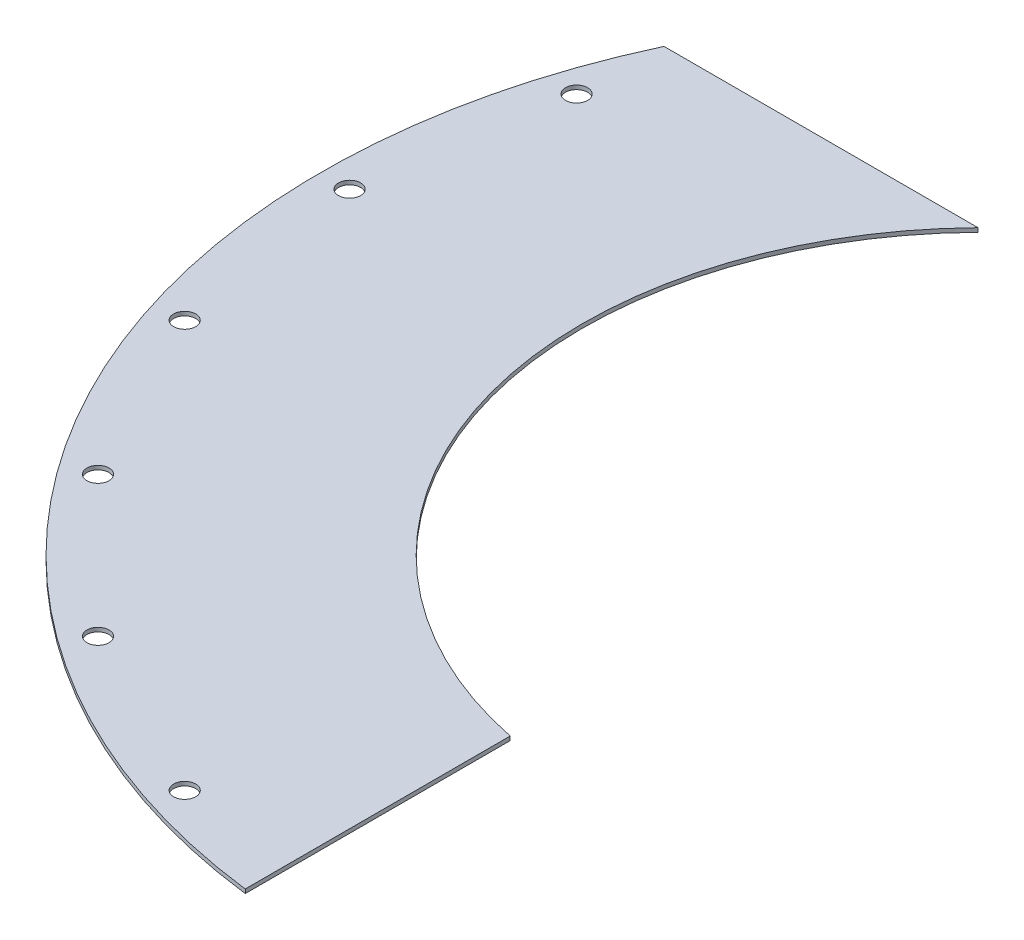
ISO-10303-21;
HEADER;
FILE_DESCRIPTION(('STEP AP214'),'2;1');
FILE_NAME('part.step','',(''),(''),'','','');
FILE_SCHEMA(('AUTOMOTIVE_DESIGN { 1 0 10303 214 1 1 1 1 }'));
ENDSEC;
DATA;
#1=APPLICATION_CONTEXT('core data for automotive mechanical design processes');
#2=APPLICATION_PROTOCOL_DEFINITION('international standard','automotive_design',2000,#1);
#3=PRODUCT_CONTEXT('',#1,'mechanical');
#4=PRODUCT('Part','Part','',(#3));
#5=PRODUCT_RELATED_PRODUCT_CATEGORY('part','',(#4));
#6=PRODUCT_DEFINITION_FORMATION('','',#4);
#7=PRODUCT_DEFINITION_CONTEXT('part definition',#1,'design');
#8=PRODUCT_DEFINITION('design','',#6,#7);
#9=PRODUCT_DEFINITION_SHAPE('','',#8);
#10=(LENGTH_UNIT() NAMED_UNIT(*) SI_UNIT(.MILLI.,.METRE.));
#11=(NAMED_UNIT(*) PLANE_ANGLE_UNIT() SI_UNIT($,.RADIAN.));
#12=(NAMED_UNIT(*) SI_UNIT($,.STERADIAN.) SOLID_ANGLE_UNIT());
#13=UNCERTAINTY_MEASURE_WITH_UNIT(LENGTH_MEASURE(1.E-05),#10,'distance_accuracy_value','');
#14=(GEOMETRIC_REPRESENTATION_CONTEXT(3) GLOBAL_UNCERTAINTY_ASSIGNED_CONTEXT((#13)) GLOBAL_UNIT_ASSIGNED_CONTEXT((#10,
#11,#12)) REPRESENTATION_CONTEXT('',''));
#15=CARTESIAN_POINT('',(0.,0.,0.));
#16=DIRECTION('',(0.,0.,1.));
#17=DIRECTION('',(1.,0.,0.));
#18=AXIS2_PLACEMENT_3D('',#15,#16,#17);
#19=CARTESIAN_POINT('',(0.,0.,0.));
#20=DIRECTION('',(0.,1.,0.));
#21=DIRECTION('',(0.,0.,1.));
#22=AXIS2_PLACEMENT_3D('',#19,#20,#21);
#23=PLANE('',#22);
#24=CARTESIAN_POINT('',(90.,0.,86.));
#25=DIRECTION('',(0.,1.,0.));
#26=DIRECTION('',(0.,0.,1.));
#27=AXIS2_PLACEMENT_3D('',#24,#25,#26);
#28=CIRCLE('',#27,165.215011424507);
#29=CARTESIAN_POINT('',(-59.6529318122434,0.,16.0000000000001));
#30=VERTEX_POINT('',#29);
#31=CARTESIAN_POINT('',(70.,0.,250.));
#32=VERTEX_POINT('',#31);
#33=EDGE_CURVE('E56',#30,#32,#28,.T.);
#34=ORIENTED_EDGE('',*,*,#33,.F.);
#35=DIRECTION('',(1.,0.,0.));
#36=VECTOR('',#35,1.);
#37=CARTESIAN_POINT('',(-59.6529318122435,0.,16.0000000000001));
#38=LINE('',#37,#36);
#39=CARTESIAN_POINT('',(18.5857157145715,0.,16.0000000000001));
#40=VERTEX_POINT('',#39);
#41=EDGE_CURVE('E61',#30,#40,#38,.T.);
#42=ORIENTED_EDGE('',*,*,#41,.T.);
#43=CARTESIAN_POINT('',(90.,0.,86.));
#44=DIRECTION('',(0.,1.,0.));
#45=DIRECTION('',(0.,0.,1.));
#46=AXIS2_PLACEMENT_3D('',#43,#44,#45);
#47=CIRCLE('',#46,100.);
#48=CARTESIAN_POINT('',(70.,0.,183.979589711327));
#49=VERTEX_POINT('',#48);
#50=EDGE_CURVE('E103',#40,#49,#47,.T.);
#51=ORIENTED_EDGE('',*,*,#50,.T.);
#52=DIRECTION('',(0.,0.,1.));
#53=VECTOR('',#52,1.);
#54=CARTESIAN_POINT('',(70.,0.,250.));
#55=LINE('',#54,#53);
#56=EDGE_CURVE('E62',#49,#32,#55,.T.);
#57=ORIENTED_EDGE('',*,*,#56,.T.);
#58=EDGE_LOOP('',(#34,#42,#51,#57));
#59=FACE_BOUND('',#58,.T.);
#60=CARTESIAN_POINT('',(-68.,0.,86.0000000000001));
#61=DIRECTION('',(0.,1.,0.));
#62=DIRECTION('',(0.,0.,1.));
#63=AXIS2_PLACEMENT_3D('',#60,#61,#62);
#64=CIRCLE('',#63,2.75);
#65=CARTESIAN_POINT('',(-68.,0.,88.7500000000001));
#66=VERTEX_POINT('',#65);
#67=EDGE_CURVE('E65',#66,#66,#64,.T.);
#68=ORIENTED_EDGE('',*,*,#67,.T.);
#69=EDGE_LOOP('',(#68));
#70=FACE_BOUND('',#69,.T.);
#71=CARTESIAN_POINT('',(-60.2669295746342,0.,134.824685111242));
#72=DIRECTION('',(0.,1.,0.));
#73=DIRECTION('',(0.,0.,1.));
#74=AXIS2_PLACEMENT_3D('',#71,#72,#73);
#75=CIRCLE('',#74,2.75);
#76=CARTESIAN_POINT('',(-60.2669295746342,0.,137.574685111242));
#77=VERTEX_POINT('',#76);
#78=EDGE_CURVE('E108',#77,#77,#75,.T.);
#79=ORIENTED_EDGE('',*,*,#78,.T.);
#80=EDGE_LOOP('',(#79));
#81=FACE_BOUND('',#80,.T.);
#82=CARTESIAN_POINT('',(-37.8246851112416,0.,178.870069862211));
#83=DIRECTION('',(0.,1.,0.));
#84=DIRECTION('',(0.,0.,1.));
#85=AXIS2_PLACEMENT_3D('',#82,#83,#84);
#86=CIRCLE('',#85,2.75);
#87=CARTESIAN_POINT('',(-37.8246851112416,0.,181.620069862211));
#88=VERTEX_POINT('',#87);
#89=EDGE_CURVE('E111',#88,#88,#86,.T.);
#90=ORIENTED_EDGE('',*,*,#89,.T.);
#91=EDGE_LOOP('',(#90));
#92=FACE_BOUND('',#91,.T.);
#93=CARTESIAN_POINT('',(-2.87006986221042,0.,213.824685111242));
#94=DIRECTION('',(0.,1.,0.));
#95=DIRECTION('',(0.,0.,1.));
#96=AXIS2_PLACEMENT_3D('',#93,#94,#95);
#97=CIRCLE('',#96,2.75);
#98=CARTESIAN_POINT('',(-2.87006986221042,0.,216.574685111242));
#99=VERTEX_POINT('',#98);
#100=EDGE_CURVE('E114',#99,#99,#97,.T.);
#101=ORIENTED_EDGE('',*,*,#100,.T.);
#102=EDGE_LOOP('',(#101));
#103=FACE_BOUND('',#102,.T.);
#104=CARTESIAN_POINT('',(41.1753148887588,0.,236.266929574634));
#105=DIRECTION('',(0.,1.,0.));
#106=DIRECTION('',(0.,0.,1.));
#107=AXIS2_PLACEMENT_3D('',#104,#105,#106);
#108=CIRCLE('',#107,2.75);
#109=CARTESIAN_POINT('',(41.1753148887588,0.,239.016929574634));
#110=VERTEX_POINT('',#109);
#111=EDGE_CURVE('E116',#110,#110,#108,.T.);
#112=ORIENTED_EDGE('',*,*,#111,.T.);
#113=EDGE_LOOP('',(#112));
#114=FACE_BOUND('',#113,.T.);
#115=CARTESIAN_POINT('',(-60.2669295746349,0.,37.1753148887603));
#116=DIRECTION('',(0.,1.,0.));
#117=DIRECTION('',(0.,0.,1.));
#118=AXIS2_PLACEMENT_3D('',#115,#116,#117);
#119=CIRCLE('',#118,2.75000000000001);
#120=CARTESIAN_POINT('',(-60.2669295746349,0.,39.9253148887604));
#121=VERTEX_POINT('',#120);
#122=EDGE_CURVE('E20',#121,#121,#119,.T.);
#123=ORIENTED_EDGE('',*,*,#122,.T.);
#124=EDGE_LOOP('',(#123));
#125=FACE_BOUND('',#124,.T.);
#126=ADVANCED_FACE('F17',(#59,#70,#81,#92,#103,#114,#125),#23,.F.);
#127=CARTESIAN_POINT('',(-60.2669295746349,0.,37.1753148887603));
#128=DIRECTION('',(0.,1.,0.));
#129=DIRECTION('',(0.,0.,1.));
#130=AXIS2_PLACEMENT_3D('',#127,#128,#129);
#131=CYLINDRICAL_SURFACE('',#130,2.75000000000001);
#132=CARTESIAN_POINT('',(-60.2669295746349,1.,37.1753148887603));
#133=DIRECTION('',(0.,1.,0.));
#134=DIRECTION('',(0.,0.,1.));
#135=AXIS2_PLACEMENT_3D('',#132,#133,#134);
#136=CIRCLE('',#135,2.75000000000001);
#137=CARTESIAN_POINT('',(-60.2669295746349,1.,39.9253148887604));
#138=VERTEX_POINT('',#137);
#139=EDGE_CURVE('E75',#138,#138,#136,.F.);
#140=ORIENTED_EDGE('',*,*,#139,.F.);
#141=EDGE_LOOP('',(#140));
#142=FACE_BOUND('',#141,.T.);
#143=ORIENTED_EDGE('',*,*,#122,.F.);
#144=EDGE_LOOP('',(#143));
#145=FACE_BOUND('',#144,.T.);
#146=ADVANCED_FACE('F124',(#142,#145),#131,.F.);
#147=CARTESIAN_POINT('',(41.1753148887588,0.,236.266929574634));
#148=DIRECTION('',(0.,1.,0.));
#149=DIRECTION('',(0.,0.,1.));
#150=AXIS2_PLACEMENT_3D('',#147,#148,#149);
#151=CYLINDRICAL_SURFACE('',#150,2.75);
#152=CARTESIAN_POINT('',(41.1753148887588,1.,236.266929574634));
#153=DIRECTION('',(0.,1.,0.));
#154=DIRECTION('',(0.,0.,1.));
#155=AXIS2_PLACEMENT_3D('',#152,#153,#154);
#156=CIRCLE('',#155,2.75);
#157=CARTESIAN_POINT('',(41.1753148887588,1.,239.016929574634));
#158=VERTEX_POINT('',#157);
#159=EDGE_CURVE('E78',#158,#158,#156,.F.);
#160=ORIENTED_EDGE('',*,*,#159,.F.);
#161=EDGE_LOOP('',(#160));
#162=FACE_BOUND('',#161,.T.);
#163=ORIENTED_EDGE('',*,*,#111,.F.);
#164=EDGE_LOOP('',(#163));
#165=FACE_BOUND('',#164,.T.);
#166=ADVANCED_FACE('F126',(#162,#165),#151,.F.);
#167=CARTESIAN_POINT('',(-2.87006986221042,0.,213.824685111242));
#168=DIRECTION('',(0.,1.,0.));
#169=DIRECTION('',(0.,0.,1.));
#170=AXIS2_PLACEMENT_3D('',#167,#168,#169);
#171=CYLINDRICAL_SURFACE('',#170,2.75);
#172=CARTESIAN_POINT('',(-2.87006986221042,1.,213.824685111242));
#173=DIRECTION('',(0.,1.,0.));
#174=DIRECTION('',(0.,0.,1.));
#175=AXIS2_PLACEMENT_3D('',#172,#173,#174);
#176=CIRCLE('',#175,2.75);
#177=CARTESIAN_POINT('',(-2.87006986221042,1.,216.574685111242));
#178=VERTEX_POINT('',#177);
#179=EDGE_CURVE('E98',#178,#178,#176,.F.);
#180=ORIENTED_EDGE('',*,*,#179,.F.);
#181=EDGE_LOOP('',(#180));
#182=FACE_BOUND('',#181,.T.);
#183=ORIENTED_EDGE('',*,*,#100,.F.);
#184=EDGE_LOOP('',(#183));
#185=FACE_BOUND('',#184,.T.);
#186=ADVANCED_FACE('F133',(#182,#185),#171,.F.);
#187=CARTESIAN_POINT('',(-37.8246851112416,0.,178.870069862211));
#188=DIRECTION('',(0.,1.,0.));
#189=DIRECTION('',(0.,0.,1.));
#190=AXIS2_PLACEMENT_3D('',#187,#188,#189);
#191=CYLINDRICAL_SURFACE('',#190,2.75);
#192=CARTESIAN_POINT('',(-37.8246851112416,1.,178.870069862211));
#193=DIRECTION('',(0.,1.,0.));
#194=DIRECTION('',(0.,0.,1.));
#195=AXIS2_PLACEMENT_3D('',#192,#193,#194);
#196=CIRCLE('',#195,2.75);
#197=CARTESIAN_POINT('',(-37.8246851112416,1.,181.620069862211));
#198=VERTEX_POINT('',#197);
#199=EDGE_CURVE('E95',#198,#198,#196,.F.);
#200=ORIENTED_EDGE('',*,*,#199,.F.);
#201=EDGE_LOOP('',(#200));
#202=FACE_BOUND('',#201,.T.);
#203=ORIENTED_EDGE('',*,*,#89,.F.);
#204=EDGE_LOOP('',(#203));
#205=FACE_BOUND('',#204,.T.);
#206=ADVANCED_FACE('F163',(#202,#205),#191,.F.);
#207=CARTESIAN_POINT('',(-60.2669295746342,0.,134.824685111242));
#208=DIRECTION('',(0.,1.,0.));
#209=DIRECTION('',(0.,0.,1.));
#210=AXIS2_PLACEMENT_3D('',#207,#208,#209);
#211=CYLINDRICAL_SURFACE('',#210,2.75);
#212=CARTESIAN_POINT('',(-60.2669295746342,1.,134.824685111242));
#213=DIRECTION('',(0.,1.,0.));
#214=DIRECTION('',(0.,0.,1.));
#215=AXIS2_PLACEMENT_3D('',#212,#213,#214);
#216=CIRCLE('',#215,2.75);
#217=CARTESIAN_POINT('',(-60.2669295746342,1.,137.574685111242));
#218=VERTEX_POINT('',#217);
#219=EDGE_CURVE('E92',#218,#218,#216,.F.);
#220=ORIENTED_EDGE('',*,*,#219,.F.);
#221=EDGE_LOOP('',(#220));
#222=FACE_BOUND('',#221,.T.);
#223=ORIENTED_EDGE('',*,*,#78,.F.);
#224=EDGE_LOOP('',(#223));
#225=FACE_BOUND('',#224,.T.);
#226=ADVANCED_FACE('F159',(#222,#225),#211,.F.);
#227=CARTESIAN_POINT('',(-68.,0.,86.0000000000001));
#228=DIRECTION('',(0.,1.,0.));
#229=DIRECTION('',(0.,0.,1.));
#230=AXIS2_PLACEMENT_3D('',#227,#228,#229);
#231=CYLINDRICAL_SURFACE('',#230,2.75);
#232=CARTESIAN_POINT('',(-68.,1.,86.0000000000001));
#233=DIRECTION('',(0.,1.,0.));
#234=DIRECTION('',(0.,0.,1.));
#235=AXIS2_PLACEMENT_3D('',#232,#233,#234);
#236=CIRCLE('',#235,2.75);
#237=CARTESIAN_POINT('',(-68.,1.,88.7500000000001));
#238=VERTEX_POINT('',#237);
#239=EDGE_CURVE('E89',#238,#238,#236,.F.);
#240=ORIENTED_EDGE('',*,*,#239,.F.);
#241=EDGE_LOOP('',(#240));
#242=FACE_BOUND('',#241,.T.);
#243=ORIENTED_EDGE('',*,*,#67,.F.);
#244=EDGE_LOOP('',(#243));
#245=FACE_BOUND('',#244,.T.);
#246=ADVANCED_FACE('F156',(#242,#245),#231,.F.);
#247=CARTESIAN_POINT('',(90.,0.,86.));
#248=DIRECTION('',(0.,1.,0.));
#249=DIRECTION('',(0.,0.,1.));
#250=AXIS2_PLACEMENT_3D('',#247,#248,#249);
#251=CYLINDRICAL_SURFACE('',#250,165.215011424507);
#252=ORIENTED_EDGE('',*,*,#33,.T.);
#253=DIRECTION('',(0.,1.,0.));
#254=VECTOR('',#253,1.);
#255=CARTESIAN_POINT('',(70.,0.,250.));
#256=LINE('',#255,#254);
#257=CARTESIAN_POINT('',(70.,1.,250.));
#258=VERTEX_POINT('',#257);
#259=EDGE_CURVE('E82',#32,#258,#256,.T.);
#260=ORIENTED_EDGE('',*,*,#259,.T.);
#261=CARTESIAN_POINT('',(90.,1.,86.));
#262=DIRECTION('',(0.,1.,0.));
#263=DIRECTION('',(0.,0.,1.));
#264=AXIS2_PLACEMENT_3D('',#261,#262,#263);
#265=CIRCLE('',#264,165.215011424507);
#266=CARTESIAN_POINT('',(-59.6529318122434,1.,16.0000000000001));
#267=VERTEX_POINT('',#266);
#268=EDGE_CURVE('E71',#267,#258,#265,.T.);
#269=ORIENTED_EDGE('',*,*,#268,.F.);
#270=DIRECTION('',(0.,1.,0.));
#271=VECTOR('',#270,1.);
#272=CARTESIAN_POINT('',(-59.6529318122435,0.,16.0000000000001));
#273=LINE('',#272,#271);
#274=EDGE_CURVE('E68',#267,#30,#273,.F.);
#275=ORIENTED_EDGE('',*,*,#274,.T.);
#276=EDGE_LOOP('',(#252,#260,#269,#275));
#277=FACE_BOUND('',#276,.T.);
#278=ADVANCED_FACE('F69',(#277),#251,.T.);
#279=CARTESIAN_POINT('',(70.,0.,250.));
#280=DIRECTION('',(-1.,0.,0.));
#281=DIRECTION('',(0.,0.,1.));
#282=AXIS2_PLACEMENT_3D('',#279,#280,#281);
#283=PLANE('',#282);
#284=ORIENTED_EDGE('',*,*,#259,.F.);
#285=ORIENTED_EDGE('',*,*,#56,.F.);
#286=DIRECTION('',(0.,1.,0.));
#287=VECTOR('',#286,1.);
#288=CARTESIAN_POINT('',(70.,0.,183.979589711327));
#289=LINE('',#288,#287);
#290=CARTESIAN_POINT('',(70.,1.,183.979589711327));
#291=VERTEX_POINT('',#290);
#292=EDGE_CURVE('E104',#49,#291,#289,.T.);
#293=ORIENTED_EDGE('',*,*,#292,.T.);
#294=DIRECTION('',(0.,0.,1.));
#295=VECTOR('',#294,1.);
#296=CARTESIAN_POINT('',(70.,1.,0.));
#297=LINE('',#296,#295);
#298=EDGE_CURVE('E87',#258,#291,#297,.F.);
#299=ORIENTED_EDGE('',*,*,#298,.F.);
#300=EDGE_LOOP('',(#284,#285,#293,#299));
#301=FACE_BOUND('',#300,.T.);
#302=ADVANCED_FACE('F150',(#301),#283,.F.);
#303=CARTESIAN_POINT('',(90.,0.,86.));
#304=DIRECTION('',(0.,1.,0.));
#305=DIRECTION('',(0.,0.,1.));
#306=AXIS2_PLACEMENT_3D('',#303,#304,#305);
#307=CYLINDRICAL_SURFACE('',#306,100.);
#308=DIRECTION('',(0.,1.,0.));
#309=VECTOR('',#308,1.);
#310=CARTESIAN_POINT('',(18.5857157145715,0.,16.0000000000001));
#311=LINE('',#310,#309);
#312=CARTESIAN_POINT('',(18.5857157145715,1.,16.0000000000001));
#313=VERTEX_POINT('',#312);
#314=EDGE_CURVE('E35',#40,#313,#311,.T.);
#315=ORIENTED_EDGE('',*,*,#314,.T.);
#316=CARTESIAN_POINT('',(90.,1.,86.));
#317=DIRECTION('',(0.,1.,0.));
#318=DIRECTION('',(0.,0.,1.));
#319=AXIS2_PLACEMENT_3D('',#316,#317,#318);
#320=CIRCLE('',#319,100.);
#321=EDGE_CURVE('E26',#291,#313,#320,.F.);
#322=ORIENTED_EDGE('',*,*,#321,.F.);
#323=ORIENTED_EDGE('',*,*,#292,.F.);
#324=ORIENTED_EDGE('',*,*,#50,.F.);
#325=EDGE_LOOP('',(#315,#322,#323,#324));
#326=FACE_BOUND('',#325,.T.);
#327=ADVANCED_FACE('F144',(#326),#307,.F.);
#328=CARTESIAN_POINT('',(-59.6529318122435,0.,16.0000000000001));
#329=DIRECTION('',(0.,0.,1.));
#330=DIRECTION('',(1.,0.,0.));
#331=AXIS2_PLACEMENT_3D('',#328,#329,#330);
#332=PLANE('',#331);
#333=ORIENTED_EDGE('',*,*,#274,.F.);
#334=DIRECTION('',(1.,0.,0.));
#335=VECTOR('',#334,1.);
#336=CARTESIAN_POINT('',(0.,1.,16.0000000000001));
#337=LINE('',#336,#335);
#338=EDGE_CURVE('E11',#313,#267,#337,.F.);
#339=ORIENTED_EDGE('',*,*,#338,.F.);
#340=ORIENTED_EDGE('',*,*,#314,.F.);
#341=ORIENTED_EDGE('',*,*,#41,.F.);
#342=EDGE_LOOP('',(#333,#339,#340,#341));
#343=FACE_BOUND('',#342,.T.);
#344=ADVANCED_FACE('F74',(#343),#332,.F.);
#345=CARTESIAN_POINT('',(0.,1.,0.));
#346=DIRECTION('',(0.,1.,0.));
#347=DIRECTION('',(0.,0.,1.));
#348=AXIS2_PLACEMENT_3D('',#345,#346,#347);
#349=PLANE('',#348);
#350=ORIENTED_EDGE('',*,*,#321,.T.);
#351=ORIENTED_EDGE('',*,*,#338,.T.);
#352=ORIENTED_EDGE('',*,*,#268,.T.);
#353=ORIENTED_EDGE('',*,*,#298,.T.);
#354=EDGE_LOOP('',(#350,#351,#352,#353));
#355=FACE_BOUND('',#354,.T.);
#356=ORIENTED_EDGE('',*,*,#239,.T.);
#357=EDGE_LOOP('',(#356));
#358=FACE_BOUND('',#357,.T.);
#359=ORIENTED_EDGE('',*,*,#219,.T.);
#360=EDGE_LOOP('',(#359));
#361=FACE_BOUND('',#360,.T.);
#362=ORIENTED_EDGE('',*,*,#199,.T.);
#363=EDGE_LOOP('',(#362));
#364=FACE_BOUND('',#363,.T.);
#365=ORIENTED_EDGE('',*,*,#179,.T.);
#366=EDGE_LOOP('',(#365));
#367=FACE_BOUND('',#366,.T.);
#368=ORIENTED_EDGE('',*,*,#159,.T.);
#369=EDGE_LOOP('',(#368));
#370=FACE_BOUND('',#369,.T.);
#371=ORIENTED_EDGE('',*,*,#139,.T.);
#372=EDGE_LOOP('',(#371));
#373=FACE_BOUND('',#372,.T.);
#374=ADVANCED_FACE('F137',(#355,#358,#361,#364,#367,#370,#373),#349,.T.);
#375=CLOSED_SHELL('',(#126,#146,#166,#186,#206,#226,#246,#278,#302,#327,#344,#374));
#376=MANIFOLD_SOLID_BREP('B1',#375);
#377=ADVANCED_BREP_SHAPE_REPRESENTATION('',(#18,#376),#14);
#378=SHAPE_DEFINITION_REPRESENTATION(#9,#377);
ENDSEC;
END-ISO-10303-21;
